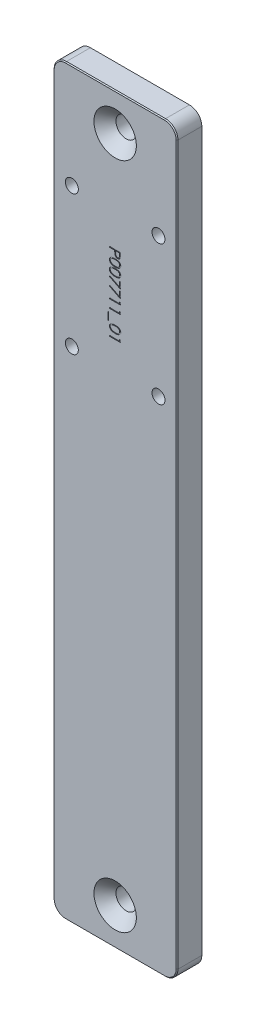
from build123d import *

# Parameters (mm, degrees)
SKIZZE2_R                                            = 3.3
SKIZZE2_R_2                                          = 0.5
AUFSATZ_LINEAR_AUSTRAGEN1_DEPTH                      = 8
M5_GEWINDEBOHRUNG1_D                                 = 4.2
M5_GEWINDEBOHRUNG1_DEPTH                             = 14
M5_GEWINDEBOHRUNG1_TIP                               = 1.2618073
FORMSENKUNG_F_R_M6_SENKSCHRAUBE_MIT_INNE_D           = 6.6
FORMSENKUNG_F_R_M6_SENKSCHRAUBE_MIT_INNE_DEPTH       = 11.5
FORMSENKUNG_F_R_M6_SENKSCHRAUBE_MIT_INNE_CSINK_D     = 13.71
FORMSENKUNG_F_R_M6_SENKSCHRAUBE_MIT_INNE_CSINK_ANGLE = 90
FORMSENKUNG_F_R_M6_SENKSCHRAUBE_MIT_INNE_TIP         = 1.982840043
FASE1_SIZE                                           = 0.3
SKIZZE7_W                                            = 0.224358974
SKIZZE7_H                                            = 2.512820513
BESCHRIFTUNG_DEPTH                                   = 0.2


with BuildPart() as part:
    # Skizze2 → Aufsatz-Linear austragen1 (new body)
    with BuildSketch(Plane.XY):
        with BuildLine():
            Line((-16, -140), (16, -140))
            ThreePointArc((16, -140), (18.828427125, -138.828427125), (20, -136))
            Line((20, -136), (20, 96))
            ThreePointArc((20, 96), (18.828427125, 98.828427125), (16, 100))
            Line((16, 100), (-16, 100))
            ThreePointArc((-16, 100), (-18.828427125, 98.828427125), (-20, 96))
            Line((-20, 96), (-20, -136))
            ThreePointArc((-20, -136), (-18.828427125, -138.828427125), (-16, -140))
        make_face()
        with Locations((0, 88)):
            Circle(SKIZZE2_R, mode=Mode.SUBTRACT)
        with Locations((0, -128)):
            Circle(SKIZZE2_R, mode=Mode.SUBTRACT)
        with Locations((14, 21.4)):
            Circle(SKIZZE2_R_2, mode=Mode.SUBTRACT)
        with Locations((-14, 21.4)):
            Circle(SKIZZE2_R_2, mode=Mode.SUBTRACT)
        with Locations((-14, 66.399999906)):
            Circle(SKIZZE2_R_2, mode=Mode.SUBTRACT)
        with Locations((14, 66.399999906)):
            Circle(SKIZZE2_R_2, mode=Mode.SUBTRACT)
    extrude(amount=AUFSATZ_LINEAR_AUSTRAGEN1_DEPTH)

    # M5 Gewindebohrung1
    with Locations(Plane.XY.offset(8)):
        with Locations((-14, 21.4), (14, 21.4), (14, 66.399999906), (-14, 66.399999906)):
            Hole(M5_GEWINDEBOHRUNG1_D / 2, depth=M5_GEWINDEBOHRUNG1_DEPTH)
            with Locations((0, 0, -(M5_GEWINDEBOHRUNG1_DEPTH + M5_GEWINDEBOHRUNG1_TIP / 2))):  # 118° drill point
                Cone(0, M5_GEWINDEBOHRUNG1_D / 2, M5_GEWINDEBOHRUNG1_TIP, mode=Mode.SUBTRACT)

    # Formsenkung f_r M6 Senkschraube mit Inne
    with Locations(Plane.XY.offset(8)):
        with Locations((0, 88), (0, -128)):
            CounterSinkHole(FORMSENKUNG_F_R_M6_SENKSCHRAUBE_MIT_INNE_D / 2, FORMSENKUNG_F_R_M6_SENKSCHRAUBE_MIT_INNE_CSINK_D / 2, depth=FORMSENKUNG_F_R_M6_SENKSCHRAUBE_MIT_INNE_DEPTH, counter_sink_angle=FORMSENKUNG_F_R_M6_SENKSCHRAUBE_MIT_INNE_CSINK_ANGLE)
            with Locations((0, 0, -(FORMSENKUNG_F_R_M6_SENKSCHRAUBE_MIT_INNE_DEPTH + FORMSENKUNG_F_R_M6_SENKSCHRAUBE_MIT_INNE_TIP / 2))):  # 118° drill point
                Cone(0, FORMSENKUNG_F_R_M6_SENKSCHRAUBE_MIT_INNE_D / 2, FORMSENKUNG_F_R_M6_SENKSCHRAUBE_MIT_INNE_TIP, mode=Mode.SUBTRACT)

    # Fase1
    fase1_edges = [part.edges().sort_by_distance(p)[0] for p in [
        (18.828427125, -138.828427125, 8),
        (20, -20, 8),
        (18.828427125, 98.828427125, 8),
        (0, 100, 8),
        (-18.828427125, 98.828427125, 8),
        (-20, -20, 8),
        (-18.828427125, -138.828427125, 8),
        (0, -140, 8),
    ]]
    chamfer(fase1_edges, length=FASE1_SIZE)

    # Skizze7 → Beschriftung (cut)
    # profile 1 of 10: a face of its own
    with BuildSketch(Plane.XY.offset(8)):
        with BuildLine():
            Line((1.75, 55.551282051), (1.75, 54.864883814))
            add(Edge.make_bspline(
                [(1.75, 54.864883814), (1.749948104, 54.817672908), (1.749848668, 54.727214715), (1.746833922, 54.597499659), (1.74280723, 54.479689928), (1.737225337, 54.374039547), (1.730628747, 54.280223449), (1.721376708, 54.198666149), (1.711716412, 54.128726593), (1.701895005, 54.086820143), (1.697415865, 54.067708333)],
                knots=[0, 0, 0, 0, 1.415646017, 2.712440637, 3.8905458, 4.950247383, 5.884950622, 6.709939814, 7.411656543, 8, 8, 8, 8], degree=3))
            add(Edge.make_bspline(
                [(1.697415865, 54.067708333), (1.690793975, 54.043514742), (1.67770623, 53.995697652), (1.651491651, 53.926797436), (1.620412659, 53.861240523), (1.584976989, 53.798820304), (1.543734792, 53.740236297), (1.497990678, 53.684738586), (1.447769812, 53.632008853), (1.392098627, 53.58383831), (1.333029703, 53.539491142), (1.269247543, 53.501447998), (1.202140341, 53.469268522), (1.131020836, 53.44298769), (1.056321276, 53.42300412), (0.977823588, 53.408239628), (0.895797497, 53.398793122), (0.839736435, 53.397893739), (0.811197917, 53.397435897)],
                knots=[0, 0, 0, 0, 0.999487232, 1.975422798, 2.933948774, 3.889618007, 4.832992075, 5.786114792, 6.754729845, 7.731954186, 8.717668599, 9.695514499, 10.68728626, 11.680675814, 12.71351902, 13.766008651, 14.862761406, 16, 16, 16, 16], degree=3))
            add(Edge.make_bspline(
                [(0.811197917, 53.397435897), (0.78242014, 53.397857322), (0.726114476, 53.398681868), (0.643741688, 53.408578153), (0.565023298, 53.421908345), (0.490133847, 53.442405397), (0.419518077, 53.46925107), (0.352096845, 53.500743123), (0.289017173, 53.538726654), (0.230050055, 53.582371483), (0.175140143, 53.630923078), (0.124685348, 53.684176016), (0.07898101, 53.741915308), (0.037924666, 53.803957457), (0.002468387, 53.870907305), (-0.029288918, 53.941749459), (-0.055959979, 54.017099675), (-0.06999004, 54.069242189), (-0.077123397, 54.095753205)],
                knots=[0, 0, 0, 0, 1.121902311, 2.195077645, 3.232258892, 4.234102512, 5.217864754, 6.176164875, 7.132989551, 8.084763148, 9.034132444, 9.988522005, 10.94243251, 11.903244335, 12.886203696, 13.894208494, 14.929344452, 16, 16, 16, 16], degree=3))
            add(Edge.make_bspline(
                [(-0.077123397, 54.095753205), (-0.081786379, 54.117680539), (-0.092005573, 54.165735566), (-0.10341403, 54.244878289), (-0.11315163, 54.337023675), (-0.120452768, 54.442045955), (-0.126703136, 54.559850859), (-0.13167123, 54.690502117), (-0.134401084, 54.834256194), (-0.134541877, 54.934527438), (-0.134615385, 54.986879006)],
                knots=[0, 0, 0, 0, 0.601384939, 1.31797006, 2.144135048, 3.087295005, 4.142315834, 5.309527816, 6.595305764, 8, 8, 8, 8], degree=3))
            Line((-0.134615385, 54.986879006), (-0.134615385, 55.237179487))
            Line((-0.134615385, 55.237179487), (-1.75, 55.237179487))
            Line((-1.75, 55.237179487), (-1.75, 55.551282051))
            Line((-1.75, 55.551282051), (1.75, 55.551282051))
        make_face()
        with BuildLine():
            Line((1.391025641, 55.237179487), (0.224358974, 55.237179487))
            Line((0.224358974, 55.237179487), (0.216646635, 54.624399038))
            add(Edge.make_bspline(
                [(0.216646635, 54.624399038), (0.216627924, 54.59447882), (0.216591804, 54.536718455), (0.220631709, 54.453053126), (0.225087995, 54.375630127), (0.232066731, 54.304281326), (0.24126187, 54.239551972), (0.251270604, 54.180610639), (0.264830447, 54.128320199), (0.283737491, 54.067045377), (0.315355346, 53.998998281), (0.362432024, 53.92546175), (0.420792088, 53.862131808), (0.487310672, 53.807694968), (0.561578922, 53.765506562), (0.640418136, 53.733775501), (0.723877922, 53.715292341), (0.780961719, 53.712798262), (0.809795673, 53.711538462)],
                knots=[0, 0, 0, 0, 1.160368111, 2.240066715, 3.248291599, 4.168343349, 5.019594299, 5.784185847, 6.485545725, 7.113397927, 8.269509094, 9.383373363, 10.487084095, 11.595623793, 12.704274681, 13.786671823, 14.88201193, 16, 16, 16, 16], degree=3))
            add(Edge.make_bspline(
                [(0.809795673, 53.711538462), (0.837932, 53.712804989), (0.893863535, 53.715322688), (0.975874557, 53.733921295), (1.053877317, 53.76544462), (1.127231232, 53.807980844), (1.193477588, 53.860854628), (1.250520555, 53.922781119), (1.297000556, 53.992495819), (1.326793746, 54.057379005), (1.345014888, 54.114975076), (1.357758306, 54.165008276), (1.367934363, 54.221498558), (1.376173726, 54.284466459), (1.383227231, 54.353423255), (1.388013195, 54.428961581), (1.390814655, 54.510795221), (1.39095361, 54.567605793), (1.391025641, 54.597055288)],
                knots=[0, 0, 0, 0, 1.120550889, 2.227516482, 3.330715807, 4.461473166, 5.594337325, 6.694900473, 7.802844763, 8.919519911, 9.52614448, 10.208195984, 10.975273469, 11.811520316, 12.738076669, 13.736566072, 14.826679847, 16, 16, 16, 16], degree=3))
            Line((1.391025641, 54.597055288), (1.391025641, 55.237179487))
        make_face(mode=Mode.SUBTRACT)
    # profile 2 of 10: a face of its own
    with BuildSketch(Plane.XY.offset(8)):
        with BuildLine():
            add(Edge.make_bspline(
                [(-0.001402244, 52.993589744), (0.054695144, 52.993261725), (0.163665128, 52.992624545), (0.32244977, 52.985536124), (0.47141006, 52.973760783), (0.610553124, 52.957623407), (0.739914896, 52.937985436), (0.859149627, 52.91176992), (0.968809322, 52.881957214), (1.069251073, 52.847404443), (1.1618298, 52.808417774), (1.24825139, 52.765979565), (1.328406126, 52.71842877), (1.403498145, 52.668401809), (1.472689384, 52.614070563), (1.535848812, 52.556008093), (1.593014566, 52.493638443), (1.644867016, 52.428195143), (1.690037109, 52.359264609), (1.730738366, 52.288971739), (1.764144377, 52.21607616), (1.791593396, 52.141242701), (1.8135876, 52.064688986), (1.828818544, 51.986098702), (1.838364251, 51.905452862), (1.839279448, 51.851022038), (1.83974359, 51.823417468)],
                knots=[0, 0, 0, 0, 1.646377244, 3.198111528, 4.663803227, 6.031090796, 7.308794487, 8.502186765, 9.612154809, 10.642545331, 11.617106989, 12.558866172, 13.465886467, 14.35053239, 15.20542558, 16.045215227, 16.865619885, 17.686225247, 18.492864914, 19.282407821, 20.068097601, 20.842842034, 21.620163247, 22.403093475, 23.190129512, 24, 24, 24, 24], degree=3))
            add(Edge.make_bspline(
                [(1.83974359, 51.823417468), (1.839255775, 51.795581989), (1.838285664, 51.740225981), (1.828961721, 51.658385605), (1.813490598, 51.578435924), (1.791569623, 51.500717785), (1.764373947, 51.424592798), (1.73028683, 51.350656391), (1.690607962, 51.278449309), (1.643984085, 51.209119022), (1.592001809, 51.141904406), (1.53323914, 51.078456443), (1.468289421, 51.018769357), (1.397847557, 50.962094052), (1.320562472, 50.910038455), (1.237778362, 50.860465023), (1.148047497, 50.816092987), (1.05286703, 50.773358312), (0.949603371, 50.736471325), (0.83883861, 50.70320508), (0.719264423, 50.676326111), (0.591508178, 50.653936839), (0.455100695, 50.636591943), (0.310334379, 50.623959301), (0.157113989, 50.617286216), (0.05235614, 50.616029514), (-0.001402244, 50.615384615)],
                knots=[0, 0, 0, 0, 0.810914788, 1.612654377, 2.396697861, 3.181598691, 3.963628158, 4.749916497, 5.551656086, 6.361998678, 7.18212741, 8.025565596, 8.878627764, 9.750805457, 10.657531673, 11.591944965, 12.560506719, 13.57287815, 14.630710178, 15.753379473, 16.941251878, 18.199788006, 19.531962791, 20.947069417, 22.433333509, 24, 24, 24, 24], degree=3))
            add(Edge.make_bspline(
                [(-0.001402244, 50.615384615), (-0.054925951, 50.616037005), (-0.159214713, 50.61730816), (-0.311748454, 50.623875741), (-0.455736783, 50.636873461), (-0.59158051, 50.65294959), (-0.718473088, 50.675849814), (-0.83762111, 50.701883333), (-0.947996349, 50.734240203), (-1.050715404, 50.770624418), (-1.145429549, 50.812431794), (-1.234384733, 50.857195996), (-1.317101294, 50.906465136), (-1.394385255, 50.958831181), (-1.465438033, 51.015024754), (-1.530435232, 51.074964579), (-1.58933398, 51.138696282), (-1.642026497, 51.206062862), (-1.688107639, 51.276483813), (-1.729296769, 51.348449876), (-1.762719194, 51.42339743), (-1.790938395, 51.499660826), (-1.812909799, 51.577959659), (-1.827953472, 51.658217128), (-1.838533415, 51.740170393), (-1.839338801, 51.795572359), (-1.83974359, 51.823417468)],
                knots=[0, 0, 0, 0, 1.56130642, 3.042141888, 4.451772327, 5.777565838, 7.030558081, 8.211376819, 9.333164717, 10.383253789, 11.387583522, 12.350962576, 13.286244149, 14.193812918, 15.072134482, 15.925989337, 16.770211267, 17.600669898, 18.417446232, 19.22325363, 20.01647746, 20.807971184, 21.593601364, 22.38506573, 23.188331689, 24, 24, 24, 24], degree=3))
            add(Edge.make_bspline(
                [(-1.83974359, 51.823417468), (-1.839274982, 51.851020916), (-1.838350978, 51.905449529), (-1.828869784, 51.986111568), (-1.813409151, 52.064579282), (-1.792413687, 52.141009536), (-1.765729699, 52.215558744), (-1.731788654, 52.287496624), (-1.692422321, 52.357773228), (-1.647635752, 52.426067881), (-1.596311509, 52.491078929), (-1.539548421, 52.553178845), (-1.475922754, 52.610799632), (-1.406452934, 52.664449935), (-1.331728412, 52.715361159), (-1.251013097, 52.76244599), (-1.163781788, 52.804801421), (-1.070691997, 52.844661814), (-0.969512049, 52.879798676), (-0.859267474, 52.910601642), (-0.739348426, 52.936280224), (-0.610110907, 52.956931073), (-0.471458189, 52.97395562), (-0.323146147, 52.985480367), (-0.16530274, 52.992630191), (-0.05703271, 52.993264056), (-0.001402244, 52.993589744)],
                knots=[0, 0, 0, 0, 0.810940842, 1.599017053, 2.38298203, 3.159479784, 3.926441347, 4.70693857, 5.494146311, 6.292334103, 7.104379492, 7.925868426, 8.762126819, 9.623561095, 10.503686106, 11.41783325, 12.366995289, 13.351843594, 14.392337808, 15.512229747, 16.713911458, 17.994391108, 19.357476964, 20.818259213, 22.365182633, 24, 24, 24, 24], degree=3))
        make_face()
        with BuildLine():
            add(Edge.make_bspline(
                [(0, 52.679487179), (-0.046748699, 52.679367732), (-0.137478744, 52.679135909), (-0.269322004, 52.673079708), (-0.392292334, 52.664829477), (-0.506545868, 52.654188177), (-0.611695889, 52.638385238), (-0.708465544, 52.620678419), (-0.796342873, 52.599130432), (-0.875930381, 52.573635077), (-0.948580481, 52.544597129), (-1.016178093, 52.512887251), (-1.079542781, 52.478840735), (-1.138030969, 52.44067098), (-1.192224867, 52.399243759), (-1.241968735, 52.354491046), (-1.287045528, 52.306491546), (-1.340533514, 52.240044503), (-1.396460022, 52.152754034), (-1.44456109, 52.042207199), (-1.474985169, 51.928565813), (-1.478843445, 51.851411), (-1.480769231, 51.812900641)],
                knots=[0, 0, 0, 0, 1.459116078, 2.831857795, 4.118796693, 5.306371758, 6.412361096, 7.436813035, 8.376339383, 9.234574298, 10.043323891, 10.816788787, 11.564361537, 12.286735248, 12.994408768, 13.691741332, 14.372975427, 15.047457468, 16.352811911, 17.594285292, 18.799233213, 20, 20, 20, 20], degree=3))
            add(Edge.make_bspline(
                [(-1.480769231, 51.812900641), (-1.47917145, 51.774142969), (-1.475979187, 51.696707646), (-1.44518045, 51.583573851), (-1.39871091, 51.473743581), (-1.343763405, 51.387671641), (-1.291435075, 51.322189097), (-1.246820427, 51.275272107), (-1.19686456, 51.232210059), (-1.142965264, 51.191367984), (-1.08409278, 51.153908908), (-1.020530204, 51.11984577), (-0.952101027, 51.088762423), (-0.904331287, 51.071053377), (-0.879907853, 51.061999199)],
                knots=[0, 0, 0, 0, 1.353760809, 2.704726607, 4.075137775, 5.516104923, 6.260822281, 7.007110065, 7.778089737, 8.566572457, 9.372053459, 10.217411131, 11.088608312, 12, 12, 12, 12], degree=3))
            add(Edge.make_bspline(
                [(-0.879907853, 51.061999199), (-0.848678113, 51.051447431), (-0.785268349, 51.030022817), (-0.686904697, 51.002411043), (-0.583701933, 50.980665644), (-0.476276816, 50.961102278), (-0.363837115, 50.947749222), (-0.246730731, 50.937001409), (-0.124869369, 50.930670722), (-0.042074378, 50.929885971), (0, 50.929487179)],
                knots=[0, 0, 0, 0, 0.884706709, 1.796334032, 2.740027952, 3.714592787, 4.726048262, 5.777819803, 6.87074269, 8, 8, 8, 8], degree=3))
            add(Edge.make_bspline(
                [(0, 50.929487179), (0.042073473, 50.929927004), (0.124388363, 50.9307875), (0.24481512, 50.936441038), (0.359394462, 50.945525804), (0.468230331, 50.957821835), (0.571129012, 50.974701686), (0.668237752, 50.994972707), (0.75953037, 51.018738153), (0.845242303, 51.045997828), (0.925065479, 51.076719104), (0.99917369, 51.110656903), (1.067959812, 51.146873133), (1.131226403, 51.18621676), (1.189259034, 51.228212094), (1.240893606, 51.273969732), (1.28773058, 51.321674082), (1.341193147, 51.388491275), (1.395704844, 51.475965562), (1.445870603, 51.58481121), (1.474678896, 51.698081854), (1.478740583, 51.774655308), (1.480769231, 51.812900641)],
                knots=[0, 0, 0, 0, 1.313668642, 2.570134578, 3.763346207, 4.902004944, 5.98888779, 7.017888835, 7.998425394, 8.933058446, 9.82474457, 10.667209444, 11.476765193, 12.250262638, 12.991704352, 13.7104269, 14.401925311, 15.076585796, 16.378385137, 17.609787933, 18.806186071, 20, 20, 20, 20], degree=3))
            add(Edge.make_bspline(
                [(1.480769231, 51.812900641), (1.478740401, 51.851612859), (1.474679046, 51.929107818), (1.445946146, 52.04353115), (1.396171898, 52.153152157), (1.340841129, 52.239924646), (1.288677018, 52.306657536), (1.243314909, 52.353780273), (1.193420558, 52.397835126), (1.139456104, 52.439296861), (1.080938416, 52.477429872), (1.017582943, 52.511490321), (0.949979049, 52.543181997), (0.877345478, 52.572282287), (0.797637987, 52.597541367), (0.710204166, 52.620118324), (0.613344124, 52.637814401), (0.507900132, 52.653256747), (0.393506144, 52.665030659), (0.270252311, 52.673058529), (0.138181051, 52.679146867), (0.046982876, 52.67937147), (0, 52.679487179)],
                knots=[0, 0, 0, 0, 1.207964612, 2.418129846, 3.655795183, 4.951004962, 5.620895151, 6.296795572, 6.989224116, 7.696855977, 8.419187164, 9.166715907, 9.940135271, 10.748837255, 11.607021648, 12.548275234, 13.5654991, 14.678641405, 15.874140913, 17.15372626, 18.533675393, 20, 20, 20, 20], degree=3))
        make_face(mode=Mode.SUBTRACT)
    # profile 3 of 10: a face of its own
    with BuildSketch(Plane.XY.offset(8)):
        with BuildLine():
            add(Edge.make_bspline(
                [(-0.001402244, 50.301282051), (0.054695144, 50.300954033), (0.163665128, 50.300316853), (0.32244977, 50.293228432), (0.47141006, 50.28145309), (0.610553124, 50.265315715), (0.739914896, 50.245677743), (0.859149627, 50.219462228), (0.968809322, 50.189649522), (1.069251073, 50.155096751), (1.1618298, 50.116110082), (1.24825139, 50.073671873), (1.328406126, 50.026121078), (1.403498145, 49.976094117), (1.472689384, 49.921762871), (1.535848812, 49.863700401), (1.593014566, 49.801330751), (1.644867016, 49.735887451), (1.690037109, 49.666956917), (1.730738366, 49.596664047), (1.764144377, 49.523768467), (1.791593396, 49.448935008), (1.8135876, 49.372381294), (1.828818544, 49.293791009), (1.838364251, 49.213145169), (1.839279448, 49.158714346), (1.83974359, 49.131109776)],
                knots=[0, 0, 0, 0, 1.646377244, 3.198111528, 4.663803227, 6.031090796, 7.308794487, 8.502186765, 9.612154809, 10.642545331, 11.617106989, 12.558866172, 13.465886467, 14.35053239, 15.20542558, 16.045215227, 16.865619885, 17.686225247, 18.492864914, 19.282407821, 20.068097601, 20.842842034, 21.620163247, 22.403093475, 23.190129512, 24, 24, 24, 24], degree=3))
            add(Edge.make_bspline(
                [(1.83974359, 49.131109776), (1.839255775, 49.103274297), (1.838285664, 49.047918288), (1.828961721, 48.966077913), (1.813490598, 48.886128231), (1.791569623, 48.808410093), (1.764373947, 48.732285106), (1.73028683, 48.658348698), (1.690607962, 48.586141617), (1.643984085, 48.516811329), (1.592001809, 48.449596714), (1.53323914, 48.386148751), (1.468289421, 48.326461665), (1.397847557, 48.26978636), (1.320562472, 48.217730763), (1.237778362, 48.16815733), (1.148047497, 48.123785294), (1.05286703, 48.081050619), (0.949603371, 48.044163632), (0.83883861, 48.010897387), (0.719264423, 47.984018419), (0.591508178, 47.961629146), (0.455100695, 47.94428425), (0.310334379, 47.931651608), (0.157113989, 47.924978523), (0.05235614, 47.923721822), (-0.001402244, 47.923076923)],
                knots=[0, 0, 0, 0, 0.810914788, 1.612654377, 2.396697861, 3.181598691, 3.963628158, 4.749916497, 5.551656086, 6.361998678, 7.18212741, 8.025565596, 8.878627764, 9.750805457, 10.657531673, 11.591944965, 12.560506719, 13.57287815, 14.630710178, 15.753379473, 16.941251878, 18.199788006, 19.531962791, 20.947069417, 22.433333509, 24, 24, 24, 24], degree=3))
            add(Edge.make_bspline(
                [(-0.001402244, 47.923076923), (-0.054925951, 47.923729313), (-0.159214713, 47.925000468), (-0.311748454, 47.931568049), (-0.455736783, 47.944565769), (-0.59158051, 47.960641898), (-0.718473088, 47.983542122), (-0.83762111, 48.009575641), (-0.947996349, 48.04193251), (-1.050715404, 48.078316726), (-1.145429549, 48.120124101), (-1.234384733, 48.164888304), (-1.317101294, 48.214157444), (-1.394385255, 48.266523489), (-1.465438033, 48.322717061), (-1.530435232, 48.382656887), (-1.58933398, 48.446388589), (-1.642026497, 48.51375517), (-1.688107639, 48.58417612), (-1.729296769, 48.656142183), (-1.762719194, 48.731089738), (-1.790938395, 48.807353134), (-1.812909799, 48.885651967), (-1.827953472, 48.965909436), (-1.838533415, 49.047862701), (-1.839338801, 49.103264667), (-1.83974359, 49.131109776)],
                knots=[0, 0, 0, 0, 1.56130642, 3.042141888, 4.451772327, 5.777565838, 7.030558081, 8.211376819, 9.333164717, 10.383253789, 11.387583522, 12.350962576, 13.286244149, 14.193812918, 15.072134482, 15.925989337, 16.770211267, 17.600669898, 18.417446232, 19.22325363, 20.01647746, 20.807971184, 21.593601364, 22.38506573, 23.188331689, 24, 24, 24, 24], degree=3))
            add(Edge.make_bspline(
                [(-1.83974359, 49.131109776), (-1.839274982, 49.158713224), (-1.838350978, 49.213141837), (-1.828869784, 49.293803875), (-1.813409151, 49.37227159), (-1.792413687, 49.448701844), (-1.765729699, 49.523251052), (-1.731788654, 49.595188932), (-1.692422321, 49.665465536), (-1.647635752, 49.733760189), (-1.596311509, 49.798771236), (-1.539548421, 49.860871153), (-1.475922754, 49.91849194), (-1.406452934, 49.972142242), (-1.331728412, 50.023053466), (-1.251013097, 50.070138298), (-1.163781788, 50.112493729), (-1.070691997, 50.152354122), (-0.969512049, 50.187490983), (-0.859267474, 50.21829395), (-0.739348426, 50.243972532), (-0.610110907, 50.264623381), (-0.471458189, 50.281647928), (-0.323146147, 50.293172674), (-0.16530274, 50.300322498), (-0.05703271, 50.300956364), (-0.001402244, 50.301282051)],
                knots=[0, 0, 0, 0, 0.810940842, 1.599017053, 2.38298203, 3.159479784, 3.926441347, 4.70693857, 5.494146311, 6.292334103, 7.104379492, 7.925868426, 8.762126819, 9.623561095, 10.503686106, 11.41783325, 12.366995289, 13.351843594, 14.392337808, 15.512229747, 16.713911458, 17.994391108, 19.357476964, 20.818259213, 22.365182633, 24, 24, 24, 24], degree=3))
        make_face()
        with BuildLine():
            add(Edge.make_bspline(
                [(0, 49.987179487), (-0.046748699, 49.98706004), (-0.137478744, 49.986828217), (-0.269322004, 49.980772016), (-0.392292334, 49.972521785), (-0.506545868, 49.961880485), (-0.611695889, 49.946077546), (-0.708465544, 49.928370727), (-0.796342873, 49.906822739), (-0.875930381, 49.881327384), (-0.948580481, 49.852289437), (-1.016178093, 49.820579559), (-1.079542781, 49.786533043), (-1.138030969, 49.748363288), (-1.192224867, 49.706936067), (-1.241968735, 49.662183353), (-1.287045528, 49.614183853), (-1.340533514, 49.547736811), (-1.396460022, 49.460446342), (-1.44456109, 49.349899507), (-1.474985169, 49.236258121), (-1.478843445, 49.159103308), (-1.480769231, 49.120592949)],
                knots=[0, 0, 0, 0, 1.459116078, 2.831857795, 4.118796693, 5.306371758, 6.412361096, 7.436813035, 8.376339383, 9.234574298, 10.043323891, 10.816788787, 11.564361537, 12.286735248, 12.994408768, 13.691741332, 14.372975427, 15.047457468, 16.352811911, 17.594285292, 18.799233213, 20, 20, 20, 20], degree=3))
            add(Edge.make_bspline(
                [(-1.480769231, 49.120592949), (-1.47917145, 49.081835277), (-1.475979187, 49.004399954), (-1.44518045, 48.891266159), (-1.39871091, 48.781435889), (-1.343763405, 48.695363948), (-1.291435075, 48.629881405), (-1.246820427, 48.582964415), (-1.19686456, 48.539902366), (-1.142965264, 48.499060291), (-1.08409278, 48.461601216), (-1.020530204, 48.427538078), (-0.952101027, 48.396454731), (-0.904331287, 48.378745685), (-0.879907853, 48.369691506)],
                knots=[0, 0, 0, 0, 1.353760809, 2.704726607, 4.075137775, 5.516104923, 6.260822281, 7.007110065, 7.778089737, 8.566572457, 9.372053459, 10.217411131, 11.088608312, 12, 12, 12, 12], degree=3))
            add(Edge.make_bspline(
                [(-0.879907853, 48.369691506), (-0.848678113, 48.359139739), (-0.785268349, 48.337715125), (-0.686904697, 48.310103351), (-0.583701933, 48.288357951), (-0.476276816, 48.268794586), (-0.363837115, 48.25544153), (-0.246730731, 48.244693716), (-0.124869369, 48.238363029), (-0.042074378, 48.237578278), (0, 48.237179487)],
                knots=[0, 0, 0, 0, 0.884706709, 1.796334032, 2.740027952, 3.714592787, 4.726048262, 5.777819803, 6.87074269, 8, 8, 8, 8], degree=3))
            add(Edge.make_bspline(
                [(0, 48.237179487), (0.042073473, 48.237619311), (0.124388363, 48.238479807), (0.24481512, 48.244133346), (0.359394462, 48.253218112), (0.468230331, 48.265514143), (0.571129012, 48.282393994), (0.668237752, 48.302665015), (0.75953037, 48.326430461), (0.845242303, 48.353690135), (0.925065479, 48.384411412), (0.99917369, 48.418349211), (1.067959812, 48.454565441), (1.131226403, 48.493909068), (1.189259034, 48.535904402), (1.240893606, 48.58166204), (1.28773058, 48.62936639), (1.341193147, 48.696183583), (1.395704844, 48.783657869), (1.445870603, 48.892503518), (1.474678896, 49.005774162), (1.478740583, 49.082347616), (1.480769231, 49.120592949)],
                knots=[0, 0, 0, 0, 1.313668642, 2.570134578, 3.763346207, 4.902004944, 5.98888779, 7.017888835, 7.998425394, 8.933058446, 9.82474457, 10.667209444, 11.476765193, 12.250262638, 12.991704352, 13.7104269, 14.401925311, 15.076585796, 16.378385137, 17.609787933, 18.806186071, 20, 20, 20, 20], degree=3))
            add(Edge.make_bspline(
                [(1.480769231, 49.120592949), (1.478740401, 49.159305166), (1.474679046, 49.236800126), (1.445946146, 49.351223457), (1.396171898, 49.460844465), (1.340841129, 49.547616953), (1.288677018, 49.614349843), (1.243314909, 49.661472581), (1.193420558, 49.705527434), (1.139456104, 49.746989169), (1.080938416, 49.785122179), (1.017582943, 49.819182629), (0.949979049, 49.850874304), (0.877345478, 49.879974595), (0.797637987, 49.905233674), (0.710204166, 49.927810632), (0.613344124, 49.945506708), (0.507900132, 49.960949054), (0.393506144, 49.972722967), (0.270252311, 49.980750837), (0.138181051, 49.986839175), (0.046982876, 49.987063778), (0, 49.987179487)],
                knots=[0, 0, 0, 0, 1.207964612, 2.418129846, 3.655795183, 4.951004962, 5.620895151, 6.296795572, 6.989224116, 7.696855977, 8.419187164, 9.166715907, 9.940135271, 10.748837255, 11.607021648, 12.548275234, 13.5654991, 14.678641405, 15.874140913, 17.15372626, 18.533675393, 20, 20, 20, 20], degree=3))
        make_face(mode=Mode.SUBTRACT)
    # profile 4 of 10: a face of its own
    with BuildSketch(Plane.XY.offset(8)):
        Polygon((1.75, 47.384615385), (1.75, 45.230769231), (-1.83974359, 47.070512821), (-1.690404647, 47.341846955), (1.391025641, 45.762219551), (1.391025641, 47.384615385), align=None)
    # profile 5 of 10: a face of its own
    with BuildSketch(Plane.XY.offset(8)):
        Polygon((1.75, 44.692307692), (1.75, 42.538461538), (-1.83974359, 44.378205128), (-1.690404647, 44.649539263), (1.391025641, 43.069911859), (1.391025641, 44.692307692), align=None)
    # profile 6 of 10: a face of its own
    with BuildSketch(Plane.XY.offset(8)):
        Polygon((1.75, 41.48046875), (1.75, 40.833333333), (-1.75, 40.833333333), (-1.75, 41.147435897), (1.391025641, 41.147435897), (1.391025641, 41.685897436), align=None)
    # profile 7 of 10: a face of its own
    with BuildSketch(Plane.XY.offset(8)):
        Polygon((1.75, 38.788161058), (1.75, 38.141025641), (-1.75, 38.141025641), (-1.75, 38.455128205), (1.391025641, 38.455128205), (1.391025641, 38.993589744), align=None)
    # profile 8 of 10: a face of its own
    with BuildSketch(Plane.XY.offset(8)):
        with Locations((-2.221153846, 35.762820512)):
            Rectangle(SKIZZE7_W, SKIZZE7_H)
    # profile 9 of 10: a face of its own
    with BuildSketch(Plane.XY.offset(8)):
        with BuildLine():
            add(Edge.make_bspline(
                [(-0.001402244, 34.416666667), (0.054695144, 34.416338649), (0.163665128, 34.415701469), (0.32244977, 34.408613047), (0.47141006, 34.396837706), (0.610553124, 34.38070033), (0.739914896, 34.361062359), (0.859149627, 34.334846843), (0.968809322, 34.305034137), (1.069251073, 34.270481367), (1.1618298, 34.231494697), (1.24825139, 34.189056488), (1.328406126, 34.141505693), (1.403498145, 34.091478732), (1.472689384, 34.037147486), (1.535848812, 33.979085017), (1.593014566, 33.916715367), (1.644867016, 33.851272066), (1.690037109, 33.782341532), (1.730738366, 33.712048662), (1.764144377, 33.639153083), (1.791593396, 33.564319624), (1.8135876, 33.487765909), (1.828818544, 33.409175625), (1.838364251, 33.328529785), (1.839279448, 33.274098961), (1.83974359, 33.246494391)],
                knots=[0, 0, 0, 0, 1.646377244, 3.198111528, 4.663803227, 6.031090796, 7.308794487, 8.502186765, 9.612154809, 10.642545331, 11.617106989, 12.558866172, 13.465886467, 14.35053239, 15.20542558, 16.045215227, 16.865619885, 17.686225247, 18.492864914, 19.282407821, 20.068097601, 20.842842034, 21.620163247, 22.403093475, 23.190129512, 24, 24, 24, 24], degree=3))
            add(Edge.make_bspline(
                [(1.83974359, 33.246494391), (1.839255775, 33.218658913), (1.838285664, 33.163302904), (1.828961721, 33.081462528), (1.813490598, 33.001512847), (1.791569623, 32.923794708), (1.764373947, 32.847669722), (1.73028683, 32.773733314), (1.690607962, 32.701526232), (1.643984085, 32.632195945), (1.592001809, 32.564981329), (1.53323914, 32.501533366), (1.468289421, 32.44184628), (1.397847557, 32.385170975), (1.320562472, 32.333115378), (1.237778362, 32.283541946), (1.148047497, 32.23916991), (1.05286703, 32.196435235), (0.949603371, 32.159548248), (0.83883861, 32.126282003), (0.719264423, 32.099403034), (0.591508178, 32.077013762), (0.455100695, 32.059668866), (0.310334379, 32.047036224), (0.157113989, 32.040363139), (0.05235614, 32.039106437), (-0.001402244, 32.038461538)],
                knots=[0, 0, 0, 0, 0.810914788, 1.612654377, 2.396697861, 3.181598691, 3.963628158, 4.749916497, 5.551656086, 6.361998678, 7.18212741, 8.025565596, 8.878627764, 9.750805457, 10.657531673, 11.591944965, 12.560506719, 13.57287815, 14.630710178, 15.753379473, 16.941251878, 18.199788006, 19.531962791, 20.947069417, 22.433333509, 24, 24, 24, 24], degree=3))
            add(Edge.make_bspline(
                [(-0.001402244, 32.038461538), (-0.054925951, 32.039113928), (-0.159214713, 32.040385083), (-0.311748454, 32.046952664), (-0.455736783, 32.059950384), (-0.59158051, 32.076026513), (-0.718473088, 32.098926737), (-0.83762111, 32.124960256), (-0.947996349, 32.157317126), (-1.050715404, 32.193701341), (-1.145429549, 32.235508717), (-1.234384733, 32.280272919), (-1.317101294, 32.329542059), (-1.394385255, 32.381908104), (-1.465438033, 32.438101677), (-1.530435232, 32.498041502), (-1.58933398, 32.561773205), (-1.642026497, 32.629139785), (-1.688107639, 32.699560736), (-1.729296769, 32.771526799), (-1.762719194, 32.846474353), (-1.790938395, 32.922737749), (-1.812909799, 33.001036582), (-1.827953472, 33.081294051), (-1.838533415, 33.163247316), (-1.839338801, 33.218649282), (-1.83974359, 33.246494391)],
                knots=[0, 0, 0, 0, 1.56130642, 3.042141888, 4.451772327, 5.777565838, 7.030558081, 8.211376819, 9.333164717, 10.383253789, 11.387583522, 12.350962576, 13.286244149, 14.193812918, 15.072134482, 15.925989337, 16.770211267, 17.600669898, 18.417446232, 19.22325363, 20.01647746, 20.807971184, 21.593601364, 22.38506573, 23.188331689, 24, 24, 24, 24], degree=3))
            add(Edge.make_bspline(
                [(-1.83974359, 33.246494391), (-1.839274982, 33.274097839), (-1.838350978, 33.328526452), (-1.828869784, 33.409188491), (-1.813409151, 33.487656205), (-1.792413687, 33.564086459), (-1.765729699, 33.638635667), (-1.731788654, 33.710573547), (-1.692422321, 33.780850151), (-1.647635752, 33.849144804), (-1.596311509, 33.914155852), (-1.539548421, 33.976255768), (-1.475922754, 34.033876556), (-1.406452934, 34.087526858), (-1.331728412, 34.138438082), (-1.251013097, 34.185522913), (-1.163781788, 34.227878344), (-1.070691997, 34.267738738), (-0.969512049, 34.302875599), (-0.859267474, 34.333678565), (-0.739348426, 34.359357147), (-0.610110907, 34.380007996), (-0.471458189, 34.397032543), (-0.323146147, 34.40855729), (-0.16530274, 34.415707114), (-0.05703271, 34.416340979), (-0.001402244, 34.416666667)],
                knots=[0, 0, 0, 0, 0.810940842, 1.599017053, 2.38298203, 3.159479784, 3.926441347, 4.70693857, 5.494146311, 6.292334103, 7.104379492, 7.925868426, 8.762126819, 9.623561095, 10.503686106, 11.41783325, 12.366995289, 13.351843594, 14.392337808, 15.512229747, 16.713911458, 17.994391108, 19.357476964, 20.818259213, 22.365182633, 24, 24, 24, 24], degree=3))
        make_face()
        with BuildLine():
            add(Edge.make_bspline(
                [(0, 34.102564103), (-0.046748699, 34.102444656), (-0.137478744, 34.102212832), (-0.269322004, 34.096156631), (-0.392292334, 34.0879064), (-0.506545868, 34.0772651), (-0.611695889, 34.061462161), (-0.708465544, 34.043755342), (-0.796342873, 34.022207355), (-0.875930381, 33.996712), (-0.948580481, 33.967674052), (-1.016178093, 33.935964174), (-1.079542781, 33.901917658), (-1.138030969, 33.863747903), (-1.192224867, 33.822320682), (-1.241968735, 33.777567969), (-1.287045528, 33.729568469), (-1.340533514, 33.663121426), (-1.396460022, 33.575830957), (-1.44456109, 33.465284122), (-1.474985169, 33.351642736), (-1.478843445, 33.274487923), (-1.480769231, 33.235977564)],
                knots=[0, 0, 0, 0, 1.459116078, 2.831857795, 4.118796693, 5.306371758, 6.412361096, 7.436813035, 8.376339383, 9.234574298, 10.043323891, 10.816788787, 11.564361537, 12.286735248, 12.994408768, 13.691741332, 14.372975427, 15.047457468, 16.352811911, 17.594285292, 18.799233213, 20, 20, 20, 20], degree=3))
            add(Edge.make_bspline(
                [(-1.480769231, 33.235977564), (-1.47917145, 33.197219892), (-1.475979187, 33.119784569), (-1.44518045, 33.006650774), (-1.39871091, 32.896820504), (-1.343763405, 32.810748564), (-1.291435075, 32.74526602), (-1.246820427, 32.69834903), (-1.19686456, 32.655286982), (-1.142965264, 32.614444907), (-1.08409278, 32.576985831), (-1.020530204, 32.542922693), (-0.952101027, 32.511839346), (-0.904331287, 32.4941303), (-0.879907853, 32.485076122)],
                knots=[0, 0, 0, 0, 1.353760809, 2.704726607, 4.075137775, 5.516104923, 6.260822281, 7.007110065, 7.778089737, 8.566572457, 9.372053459, 10.217411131, 11.088608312, 12, 12, 12, 12], degree=3))
            add(Edge.make_bspline(
                [(-0.879907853, 32.485076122), (-0.848678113, 32.474524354), (-0.785268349, 32.45309974), (-0.686904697, 32.425487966), (-0.583701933, 32.403742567), (-0.476276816, 32.384179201), (-0.363837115, 32.370826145), (-0.246730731, 32.360078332), (-0.124869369, 32.353747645), (-0.042074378, 32.352962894), (0, 32.352564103)],
                knots=[0, 0, 0, 0, 0.884706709, 1.796334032, 2.740027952, 3.714592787, 4.726048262, 5.777819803, 6.87074269, 8, 8, 8, 8], degree=3))
            add(Edge.make_bspline(
                [(0, 32.352564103), (0.042073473, 32.353003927), (0.124388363, 32.353864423), (0.24481512, 32.359517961), (0.359394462, 32.368602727), (0.468230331, 32.380898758), (0.571129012, 32.397778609), (0.668237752, 32.41804963), (0.75953037, 32.441815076), (0.845242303, 32.469074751), (0.925065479, 32.499796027), (0.99917369, 32.533733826), (1.067959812, 32.569950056), (1.131226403, 32.609293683), (1.189259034, 32.651289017), (1.240893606, 32.697046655), (1.28773058, 32.744751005), (1.341193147, 32.811568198), (1.395704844, 32.899042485), (1.445870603, 33.007888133), (1.474678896, 33.121158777), (1.478740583, 33.197732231), (1.480769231, 33.235977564)],
                knots=[0, 0, 0, 0, 1.313668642, 2.570134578, 3.763346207, 4.902004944, 5.98888779, 7.017888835, 7.998425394, 8.933058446, 9.82474457, 10.667209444, 11.476765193, 12.250262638, 12.991704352, 13.7104269, 14.401925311, 15.076585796, 16.378385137, 17.609787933, 18.806186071, 20, 20, 20, 20], degree=3))
            add(Edge.make_bspline(
                [(1.480769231, 33.235977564), (1.478740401, 33.274689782), (1.474679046, 33.352184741), (1.445946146, 33.466608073), (1.396171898, 33.57622908), (1.340841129, 33.663001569), (1.288677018, 33.729734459), (1.243314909, 33.776857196), (1.193420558, 33.820912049), (1.139456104, 33.862373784), (1.080938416, 33.900506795), (1.017582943, 33.934567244), (0.949979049, 33.96625892), (0.877345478, 33.99535921), (0.797637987, 34.02061829), (0.710204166, 34.043195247), (0.613344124, 34.060891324), (0.507900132, 34.07633367), (0.393506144, 34.088107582), (0.270252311, 34.096135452), (0.138181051, 34.10222379), (0.046982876, 34.102448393), (0, 34.102564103)],
                knots=[0, 0, 0, 0, 1.207964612, 2.418129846, 3.655795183, 4.951004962, 5.620895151, 6.296795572, 6.989224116, 7.696855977, 8.419187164, 9.166715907, 9.940135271, 10.748837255, 11.607021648, 12.548275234, 13.5654991, 14.678641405, 15.874140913, 17.15372626, 18.533675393, 20, 20, 20, 20], degree=3))
        make_face(mode=Mode.SUBTRACT)
    # profile 10 of 10: a face of its own
    with BuildSketch(Plane.XY.offset(8)):
        Polygon((1.75, 30.98046875), (1.75, 30.333333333), (-1.75, 30.333333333), (-1.75, 30.647435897), (1.391025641, 30.647435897), (1.391025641, 31.185897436), align=None)
    extrude(amount=-BESCHRIFTUNG_DEPTH, mode=Mode.SUBTRACT)


solid = part.part
